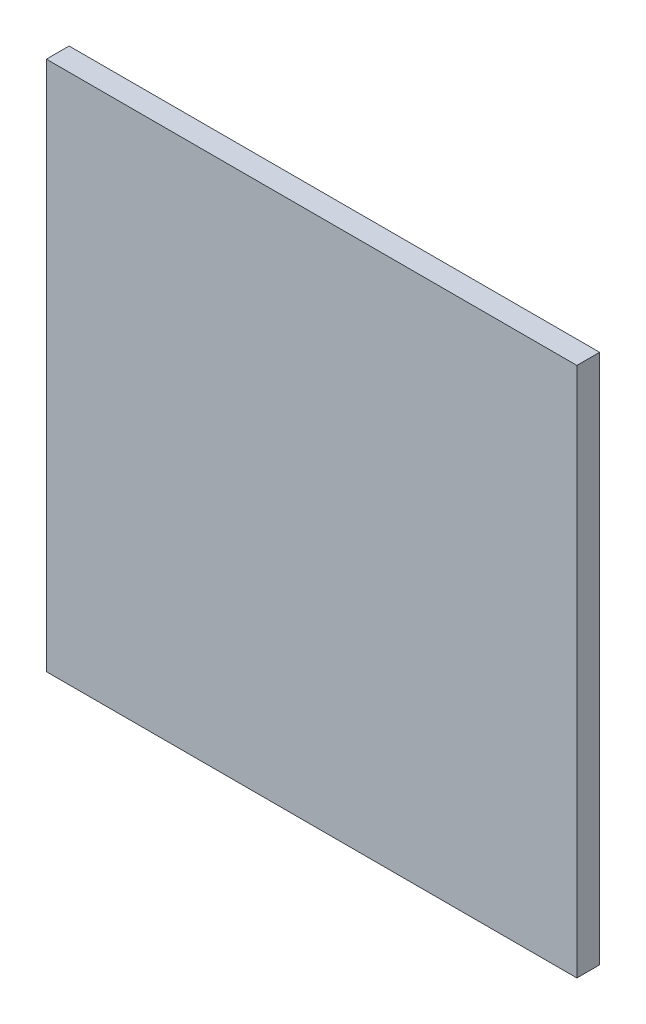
from build123d import *

# Parameters (mm, degrees)
ESQUISSE1_W        = 70
ESQUISSE1_H        = 70
BOSS_EXTRU_1_DEPTH = 3


with BuildPart() as part:
    # Esquisse1 → Boss.-Extru.1 (new body)
    with BuildSketch(Plane.XY):
        Rectangle(ESQUISSE1_W, ESQUISSE1_H)
    extrude(amount=BOSS_EXTRU_1_DEPTH)


solid = part.part
